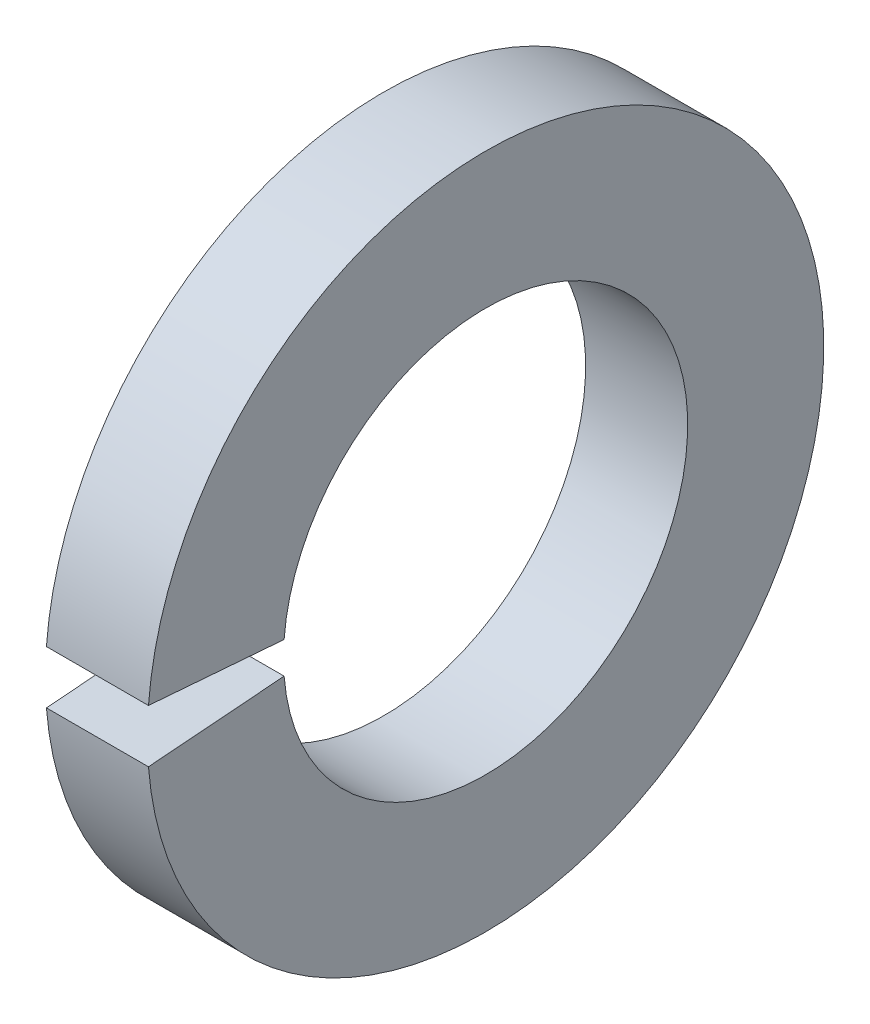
ISO-10303-21;
HEADER;
FILE_DESCRIPTION(('STEP AP214'),'2;1');
FILE_NAME('part.step','',(''),(''),'','','');
FILE_SCHEMA(('AUTOMOTIVE_DESIGN { 1 0 10303 214 1 1 1 1 }'));
ENDSEC;
DATA;
#1=APPLICATION_CONTEXT('core data for automotive mechanical design processes');
#2=APPLICATION_PROTOCOL_DEFINITION('international standard','automotive_design',2000,#1);
#3=PRODUCT_CONTEXT('',#1,'mechanical');
#4=PRODUCT('Part','Part','',(#3));
#5=PRODUCT_RELATED_PRODUCT_CATEGORY('part','',(#4));
#6=PRODUCT_DEFINITION_FORMATION('','',#4);
#7=PRODUCT_DEFINITION_CONTEXT('part definition',#1,'design');
#8=PRODUCT_DEFINITION('design','',#6,#7);
#9=PRODUCT_DEFINITION_SHAPE('','',#8);
#10=(LENGTH_UNIT() NAMED_UNIT(*) SI_UNIT(.MILLI.,.METRE.));
#11=(NAMED_UNIT(*) PLANE_ANGLE_UNIT() SI_UNIT($,.RADIAN.));
#12=(NAMED_UNIT(*) SI_UNIT($,.STERADIAN.) SOLID_ANGLE_UNIT());
#13=UNCERTAINTY_MEASURE_WITH_UNIT(LENGTH_MEASURE(1.E-05),#10,'distance_accuracy_value','');
#14=(GEOMETRIC_REPRESENTATION_CONTEXT(3) GLOBAL_UNCERTAINTY_ASSIGNED_CONTEXT((#13)) GLOBAL_UNIT_ASSIGNED_CONTEXT((#10,
#11,#12)) REPRESENTATION_CONTEXT('',''));
#15=CARTESIAN_POINT('',(0.,0.,0.));
#16=DIRECTION('',(0.,0.,1.));
#17=DIRECTION('',(1.,0.,0.));
#18=AXIS2_PLACEMENT_3D('',#15,#16,#17);
#19=CARTESIAN_POINT('',(-34.9249999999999,0.,0.));
#20=DIRECTION('',(-1.,0.,0.));
#21=DIRECTION('',(0.,0.,1.));
#22=AXIS2_PLACEMENT_3D('',#19,#20,#21);
#23=CYLINDRICAL_SURFACE('',#22,10.1);
#24=CARTESIAN_POINT('',(0.,0.,0.));
#25=DIRECTION('',(-1.,0.,0.));
#26=DIRECTION('',(0.,0.,1.));
#27=AXIS2_PLACEMENT_3D('',#24,#25,#26);
#28=CIRCLE('',#27,10.1);
#29=CARTESIAN_POINT('',(0.,0.792436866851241,10.0688650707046));
#30=VERTEX_POINT('',#29);
#31=CARTESIAN_POINT('',(0.,-0.792436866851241,10.0688650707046));
#32=VERTEX_POINT('',#31);
#33=EDGE_CURVE('E84',#30,#32,#28,.T.);
#34=ORIENTED_EDGE('',*,*,#33,.F.);
#35=DIRECTION('',(-1.,0.,0.));
#36=VECTOR('',#35,1.);
#37=CARTESIAN_POINT('',(-34.9249999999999,0.792436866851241,10.0688650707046));
#38=LINE('',#37,#36);
#39=CARTESIAN_POINT('',(-5.1,0.792436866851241,10.0688650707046));
#40=VERTEX_POINT('',#39);
#41=EDGE_CURVE('E98',#30,#40,#38,.T.);
#42=ORIENTED_EDGE('',*,*,#41,.T.);
#43=CARTESIAN_POINT('',(-5.1,0.,0.));
#44=DIRECTION('',(-1.,0.,0.));
#45=DIRECTION('',(0.,0.,1.));
#46=AXIS2_PLACEMENT_3D('',#43,#44,#45);
#47=CIRCLE('',#46,10.1);
#48=CARTESIAN_POINT('',(-5.1,-0.792436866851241,10.0688650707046));
#49=VERTEX_POINT('',#48);
#50=EDGE_CURVE('E86',#40,#49,#47,.T.);
#51=ORIENTED_EDGE('',*,*,#50,.T.);
#52=DIRECTION('',(-1.,0.,0.));
#53=VECTOR('',#52,1.);
#54=CARTESIAN_POINT('',(-34.9249999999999,-0.792436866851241,10.0688650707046));
#55=LINE('',#54,#53);
#56=EDGE_CURVE('E54',#32,#49,#55,.T.);
#57=ORIENTED_EDGE('',*,*,#56,.F.);
#58=EDGE_LOOP('',(#34,#42,#51,#57));
#59=FACE_BOUND('',#58,.T.);
#60=ADVANCED_FACE('F33',(#59),#23,.F.);
#61=CARTESIAN_POINT('',(0.,10.1,0.));
#62=DIRECTION('',(-1.,0.,0.));
#63=DIRECTION('',(0.,0.,1.));
#64=AXIS2_PLACEMENT_3D('',#61,#62,#63);
#65=PLANE('',#64);
#66=CARTESIAN_POINT('',(0.,0.,0.));
#67=DIRECTION('',(-1.,0.,0.));
#68=DIRECTION('',(0.,0.,1.));
#69=AXIS2_PLACEMENT_3D('',#66,#67,#68);
#70=CIRCLE('',#69,16.9);
#71=CARTESIAN_POINT('',(0.,1.32595871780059,16.8479029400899));
#72=VERTEX_POINT('',#71);
#73=CARTESIAN_POINT('',(0.,-1.32595871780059,16.8479029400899));
#74=VERTEX_POINT('',#73);
#75=EDGE_CURVE('E90',#72,#74,#70,.T.);
#76=ORIENTED_EDGE('',*,*,#75,.F.);
#77=DIRECTION('',(0.,0.0784590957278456,0.996917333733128));
#78=VECTOR('',#77,1.);
#79=CARTESIAN_POINT('',(0.,0.,0.));
#80=LINE('',#79,#78);
#81=EDGE_CURVE('E78',#30,#72,#80,.T.);
#82=ORIENTED_EDGE('',*,*,#81,.F.);
#83=ORIENTED_EDGE('',*,*,#33,.T.);
#84=DIRECTION('',(0.,-0.0784590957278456,0.996917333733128));
#85=VECTOR('',#84,1.);
#86=CARTESIAN_POINT('',(0.,0.,0.));
#87=LINE('',#86,#85);
#88=EDGE_CURVE('E70',#32,#74,#87,.T.);
#89=ORIENTED_EDGE('',*,*,#88,.T.);
#90=EDGE_LOOP('',(#76,#82,#83,#89));
#91=FACE_BOUND('',#90,.T.);
#92=ADVANCED_FACE('F89',(#91),#65,.F.);
#93=CARTESIAN_POINT('',(-34.9249999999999,0.,0.));
#94=DIRECTION('',(-1.,0.,0.));
#95=DIRECTION('',(0.,0.,1.));
#96=AXIS2_PLACEMENT_3D('',#93,#94,#95);
#97=CYLINDRICAL_SURFACE('',#96,16.9);
#98=CARTESIAN_POINT('',(-5.1,0.,0.));
#99=DIRECTION('',(-1.,0.,0.));
#100=DIRECTION('',(0.,0.,1.));
#101=AXIS2_PLACEMENT_3D('',#98,#99,#100);
#102=CIRCLE('',#101,16.9);
#103=CARTESIAN_POINT('',(-5.1,1.32595871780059,16.8479029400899));
#104=VERTEX_POINT('',#103);
#105=CARTESIAN_POINT('',(-5.1,-1.32595871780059,16.8479029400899));
#106=VERTEX_POINT('',#105);
#107=EDGE_CURVE('E92',#104,#106,#102,.T.);
#108=ORIENTED_EDGE('',*,*,#107,.F.);
#109=DIRECTION('',(-1.,0.,0.));
#110=VECTOR('',#109,1.);
#111=CARTESIAN_POINT('',(-34.9249999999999,1.32595871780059,16.8479029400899));
#112=LINE('',#111,#110);
#113=EDGE_CURVE('E47',#104,#72,#112,.F.);
#114=ORIENTED_EDGE('',*,*,#113,.T.);
#115=ORIENTED_EDGE('',*,*,#75,.T.);
#116=DIRECTION('',(-1.,0.,0.));
#117=VECTOR('',#116,1.);
#118=CARTESIAN_POINT('',(-34.9249999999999,-1.32595871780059,16.8479029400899));
#119=LINE('',#118,#117);
#120=EDGE_CURVE('E73',#106,#74,#119,.F.);
#121=ORIENTED_EDGE('',*,*,#120,.F.);
#122=EDGE_LOOP('',(#108,#114,#115,#121));
#123=FACE_BOUND('',#122,.T.);
#124=ADVANCED_FACE('F105',(#123),#97,.T.);
#125=CARTESIAN_POINT('',(-5.1,16.9,0.));
#126=DIRECTION('',(1.,0.,0.));
#127=DIRECTION('',(0.,0.,-1.));
#128=AXIS2_PLACEMENT_3D('',#125,#126,#127);
#129=PLANE('',#128);
#130=ORIENTED_EDGE('',*,*,#50,.F.);
#131=DIRECTION('',(0.,0.0784590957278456,0.996917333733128));
#132=VECTOR('',#131,1.);
#133=CARTESIAN_POINT('',(-5.1,0.104033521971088,1.32187122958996));
#134=LINE('',#133,#132);
#135=EDGE_CURVE('E11',#40,#104,#134,.T.);
#136=ORIENTED_EDGE('',*,*,#135,.T.);
#137=ORIENTED_EDGE('',*,*,#107,.T.);
#138=DIRECTION('',(0.,-0.0784590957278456,0.996917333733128));
#139=VECTOR('',#138,1.);
#140=CARTESIAN_POINT('',(-5.1,0.104033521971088,-1.32187122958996));
#141=LINE('',#140,#139);
#142=EDGE_CURVE('E40',#49,#106,#141,.T.);
#143=ORIENTED_EDGE('',*,*,#142,.F.);
#144=EDGE_LOOP('',(#130,#136,#137,#143));
#145=FACE_BOUND('',#144,.T.);
#146=ADVANCED_FACE('F107',(#145),#129,.F.);
#147=CARTESIAN_POINT('',(-5.1,0.,0.));
#148=DIRECTION('',(0.,0.996917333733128,0.0784590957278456));
#149=DIRECTION('',(0.,-0.0784590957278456,0.996917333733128));
#150=AXIS2_PLACEMENT_3D('',#147,#148,#149);
#151=PLANE('',#150);
#152=ORIENTED_EDGE('',*,*,#56,.T.);
#153=ORIENTED_EDGE('',*,*,#142,.T.);
#154=ORIENTED_EDGE('',*,*,#120,.T.);
#155=ORIENTED_EDGE('',*,*,#88,.F.);
#156=EDGE_LOOP('',(#152,#153,#154,#155));
#157=FACE_BOUND('',#156,.T.);
#158=ADVANCED_FACE('F71',(#157),#151,.T.);
#159=CARTESIAN_POINT('',(-5.1,0.,0.));
#160=DIRECTION('',(0.,0.996917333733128,-0.0784590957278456));
#161=DIRECTION('',(0.,0.0784590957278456,0.996917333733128));
#162=AXIS2_PLACEMENT_3D('',#159,#160,#161);
#163=PLANE('',#162);
#164=ORIENTED_EDGE('',*,*,#81,.T.);
#165=ORIENTED_EDGE('',*,*,#113,.F.);
#166=ORIENTED_EDGE('',*,*,#135,.F.);
#167=ORIENTED_EDGE('',*,*,#41,.F.);
#168=EDGE_LOOP('',(#164,#165,#166,#167));
#169=FACE_BOUND('',#168,.T.);
#170=ADVANCED_FACE('F102',(#169),#163,.F.);
#171=CLOSED_SHELL('',(#60,#92,#124,#146,#158,#170));
#172=MANIFOLD_SOLID_BREP('B2',#171);
#173=ADVANCED_BREP_SHAPE_REPRESENTATION('',(#18,#172),#14);
#174=SHAPE_DEFINITION_REPRESENTATION(#9,#173);
ENDSEC;
END-ISO-10303-21;
